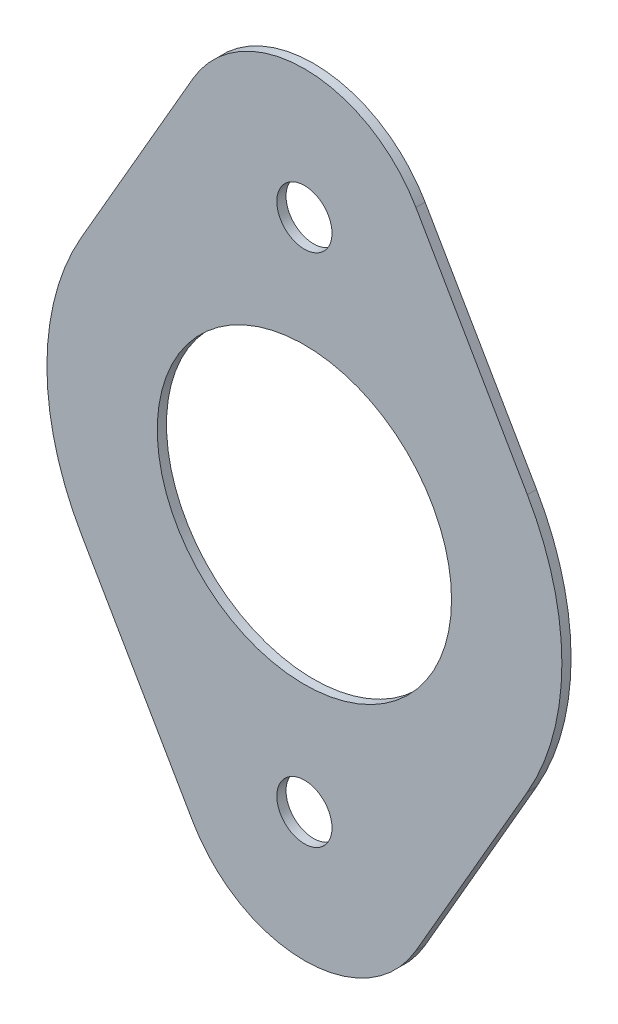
ISO-10303-21;
HEADER;
FILE_DESCRIPTION(('STEP AP214'),'2;1');
FILE_NAME('part.step','',(''),(''),'','','');
FILE_SCHEMA(('AUTOMOTIVE_DESIGN { 1 0 10303 214 1 1 1 1 }'));
ENDSEC;
DATA;
#1=APPLICATION_CONTEXT('core data for automotive mechanical design processes');
#2=APPLICATION_PROTOCOL_DEFINITION('international standard','automotive_design',2000,#1);
#3=PRODUCT_CONTEXT('',#1,'mechanical');
#4=PRODUCT('Part','Part','',(#3));
#5=PRODUCT_RELATED_PRODUCT_CATEGORY('part','',(#4));
#6=PRODUCT_DEFINITION_FORMATION('','',#4);
#7=PRODUCT_DEFINITION_CONTEXT('part definition',#1,'design');
#8=PRODUCT_DEFINITION('design','',#6,#7);
#9=PRODUCT_DEFINITION_SHAPE('','',#8);
#10=(LENGTH_UNIT() NAMED_UNIT(*) SI_UNIT(.MILLI.,.METRE.));
#11=(NAMED_UNIT(*) PLANE_ANGLE_UNIT() SI_UNIT($,.RADIAN.));
#12=(NAMED_UNIT(*) SI_UNIT($,.STERADIAN.) SOLID_ANGLE_UNIT());
#13=UNCERTAINTY_MEASURE_WITH_UNIT(LENGTH_MEASURE(1.E-05),#10,'distance_accuracy_value','');
#14=(GEOMETRIC_REPRESENTATION_CONTEXT(3) GLOBAL_UNCERTAINTY_ASSIGNED_CONTEXT((#13)) GLOBAL_UNIT_ASSIGNED_CONTEXT((#10,
#11,#12)) REPRESENTATION_CONTEXT('',''));
#15=CARTESIAN_POINT('',(0.,0.,0.));
#16=DIRECTION('',(0.,0.,1.));
#17=DIRECTION('',(1.,0.,0.));
#18=AXIS2_PLACEMENT_3D('',#15,#16,#17);
#19=CARTESIAN_POINT('',(0.,44.45,1.5875));
#20=DIRECTION('',(0.,0.,-1.));
#21=DIRECTION('',(-1.,0.,0.));
#22=AXIS2_PLACEMENT_3D('',#19,#20,#21);
#23=CYLINDRICAL_SURFACE('',#22,22.225);
#24=CARTESIAN_POINT('',(0.,44.45,0.));
#25=DIRECTION('',(0.,0.,-1.));
#26=DIRECTION('',(-1.,0.,0.));
#27=AXIS2_PLACEMENT_3D('',#24,#25,#26);
#28=CIRCLE('',#27,22.225);
#29=CARTESIAN_POINT('',(-19.2474145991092,55.5625,0.));
#30=VERTEX_POINT('',#29);
#31=CARTESIAN_POINT('',(19.2474145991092,55.5625,0.));
#32=VERTEX_POINT('',#31);
#33=EDGE_CURVE('E93',#30,#32,#28,.T.);
#34=ORIENTED_EDGE('',*,*,#33,.F.);
#35=DIRECTION('',(0.,0.,-1.));
#36=VECTOR('',#35,1.);
#37=CARTESIAN_POINT('',(-19.2474145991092,55.5625,1.5875));
#38=LINE('',#37,#36);
#39=CARTESIAN_POINT('',(-19.2474145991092,55.5625,1.5875));
#40=VERTEX_POINT('',#39);
#41=EDGE_CURVE('E11',#40,#30,#38,.T.);
#42=ORIENTED_EDGE('',*,*,#41,.F.);
#43=CARTESIAN_POINT('',(0.,44.45,1.5875));
#44=DIRECTION('',(0.,0.,-1.));
#45=DIRECTION('',(-1.,0.,0.));
#46=AXIS2_PLACEMENT_3D('',#43,#44,#45);
#47=CIRCLE('',#46,22.225);
#48=CARTESIAN_POINT('',(19.2474145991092,55.5625,1.5875));
#49=VERTEX_POINT('',#48);
#50=EDGE_CURVE('E94',#40,#49,#47,.T.);
#51=ORIENTED_EDGE('',*,*,#50,.T.);
#52=DIRECTION('',(0.,0.,-1.));
#53=VECTOR('',#52,1.);
#54=CARTESIAN_POINT('',(19.2474145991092,55.5625,1.5875));
#55=LINE('',#54,#53);
#56=EDGE_CURVE('E31',#49,#32,#55,.T.);
#57=ORIENTED_EDGE('',*,*,#56,.T.);
#58=EDGE_LOOP('',(#34,#42,#51,#57));
#59=FACE_BOUND('',#58,.T.);
#60=ADVANCED_FACE('F28',(#59),#23,.T.);
#61=CARTESIAN_POINT('',(-19.2474145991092,55.5625,1.5875));
#62=DIRECTION('',(0.866025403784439,-0.5,0.));
#63=DIRECTION('',(0.5,0.866025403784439,0.));
#64=AXIS2_PLACEMENT_3D('',#61,#62,#63);
#65=PLANE('',#64);
#66=DIRECTION('',(-0.5,-0.866025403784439,0.));
#67=VECTOR('',#66,1.);
#68=CARTESIAN_POINT('',(-19.2474145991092,55.5625,0.));
#69=LINE('',#68,#67);
#70=CARTESIAN_POINT('',(-38.4948291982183,22.225,0.));
#71=VERTEX_POINT('',#70);
#72=EDGE_CURVE('E111',#30,#71,#69,.T.);
#73=ORIENTED_EDGE('',*,*,#72,.T.);
#74=DIRECTION('',(0.,0.,-1.));
#75=VECTOR('',#74,1.);
#76=CARTESIAN_POINT('',(-38.4948291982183,22.225,1.5875));
#77=LINE('',#76,#75);
#78=CARTESIAN_POINT('',(-38.4948291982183,22.225,1.5875));
#79=VERTEX_POINT('',#78);
#80=EDGE_CURVE('E36',#79,#71,#77,.T.);
#81=ORIENTED_EDGE('',*,*,#80,.F.);
#82=DIRECTION('',(-0.5,-0.866025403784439,0.));
#83=VECTOR('',#82,1.);
#84=CARTESIAN_POINT('',(-19.2474145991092,55.5625,1.5875));
#85=LINE('',#84,#83);
#86=EDGE_CURVE('E49',#40,#79,#85,.T.);
#87=ORIENTED_EDGE('',*,*,#86,.F.);
#88=ORIENTED_EDGE('',*,*,#41,.T.);
#89=EDGE_LOOP('',(#73,#81,#87,#88));
#90=FACE_BOUND('',#89,.T.);
#91=ADVANCED_FACE('F177',(#90),#65,.F.);
#92=CARTESIAN_POINT('',(0.,0.,1.5875));
#93=DIRECTION('',(0.,0.,-1.));
#94=DIRECTION('',(-1.,0.,0.));
#95=AXIS2_PLACEMENT_3D('',#92,#93,#94);
#96=CYLINDRICAL_SURFACE('',#95,44.45);
#97=CARTESIAN_POINT('',(0.,0.,0.));
#98=DIRECTION('',(0.,0.,-1.));
#99=DIRECTION('',(-1.,0.,0.));
#100=AXIS2_PLACEMENT_3D('',#97,#98,#99);
#101=CIRCLE('',#100,44.45);
#102=CARTESIAN_POINT('',(-38.4948291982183,-22.225,0.));
#103=VERTEX_POINT('',#102);
#104=EDGE_CURVE('E128',#103,#71,#101,.T.);
#105=ORIENTED_EDGE('',*,*,#104,.F.);
#106=DIRECTION('',(0.,0.,-1.));
#107=VECTOR('',#106,1.);
#108=CARTESIAN_POINT('',(-38.4948291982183,-22.225,1.5875));
#109=LINE('',#108,#107);
#110=CARTESIAN_POINT('',(-38.4948291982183,-22.225,1.5875));
#111=VERTEX_POINT('',#110);
#112=EDGE_CURVE('E149',#111,#103,#109,.T.);
#113=ORIENTED_EDGE('',*,*,#112,.F.);
#114=CARTESIAN_POINT('',(0.,0.,1.5875));
#115=DIRECTION('',(0.,0.,-1.));
#116=DIRECTION('',(-1.,0.,0.));
#117=AXIS2_PLACEMENT_3D('',#114,#115,#116);
#118=CIRCLE('',#117,44.45);
#119=EDGE_CURVE('E144',#111,#79,#118,.T.);
#120=ORIENTED_EDGE('',*,*,#119,.T.);
#121=ORIENTED_EDGE('',*,*,#80,.T.);
#122=EDGE_LOOP('',(#105,#113,#120,#121));
#123=FACE_BOUND('',#122,.T.);
#124=ADVANCED_FACE('F175',(#123),#96,.T.);
#125=CARTESIAN_POINT('',(-19.2474145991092,-55.5625,1.5875));
#126=DIRECTION('',(-0.866025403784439,-0.5,0.));
#127=DIRECTION('',(0.5,-0.866025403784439,0.));
#128=AXIS2_PLACEMENT_3D('',#125,#126,#127);
#129=PLANE('',#128);
#130=DIRECTION('',(-0.5,0.866025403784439,0.));
#131=VECTOR('',#130,1.);
#132=CARTESIAN_POINT('',(-19.2474145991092,-55.5625,0.));
#133=LINE('',#132,#131);
#134=CARTESIAN_POINT('',(-19.2474145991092,-55.5625,0.));
#135=VERTEX_POINT('',#134);
#136=EDGE_CURVE('E125',#135,#103,#133,.T.);
#137=ORIENTED_EDGE('',*,*,#136,.F.);
#138=DIRECTION('',(0.,0.,-1.));
#139=VECTOR('',#138,1.);
#140=CARTESIAN_POINT('',(-19.2474145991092,-55.5625,1.5875));
#141=LINE('',#140,#139);
#142=CARTESIAN_POINT('',(-19.2474145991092,-55.5625,1.5875));
#143=VERTEX_POINT('',#142);
#144=EDGE_CURVE('E151',#143,#135,#141,.T.);
#145=ORIENTED_EDGE('',*,*,#144,.F.);
#146=DIRECTION('',(-0.5,0.866025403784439,0.));
#147=VECTOR('',#146,1.);
#148=CARTESIAN_POINT('',(-19.2474145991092,-55.5625,1.5875));
#149=LINE('',#148,#147);
#150=EDGE_CURVE('E141',#143,#111,#149,.T.);
#151=ORIENTED_EDGE('',*,*,#150,.T.);
#152=ORIENTED_EDGE('',*,*,#112,.T.);
#153=EDGE_LOOP('',(#137,#145,#151,#152));
#154=FACE_BOUND('',#153,.T.);
#155=ADVANCED_FACE('F170',(#154),#129,.T.);
#156=CARTESIAN_POINT('',(0.,-44.45,1.5875));
#157=DIRECTION('',(0.,0.,-1.));
#158=DIRECTION('',(-1.,0.,0.));
#159=AXIS2_PLACEMENT_3D('',#156,#157,#158);
#160=CYLINDRICAL_SURFACE('',#159,22.225);
#161=CARTESIAN_POINT('',(0.,-44.45,0.));
#162=DIRECTION('',(0.,0.,1.));
#163=DIRECTION('',(1.,0.,0.));
#164=AXIS2_PLACEMENT_3D('',#161,#162,#163);
#165=CIRCLE('',#164,22.225);
#166=CARTESIAN_POINT('',(19.2474145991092,-55.5625,0.));
#167=VERTEX_POINT('',#166);
#168=EDGE_CURVE('E123',#135,#167,#165,.T.);
#169=ORIENTED_EDGE('',*,*,#168,.T.);
#170=DIRECTION('',(0.,0.,-1.));
#171=VECTOR('',#170,1.);
#172=CARTESIAN_POINT('',(19.2474145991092,-55.5625,1.5875));
#173=LINE('',#172,#171);
#174=CARTESIAN_POINT('',(19.2474145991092,-55.5625,1.5875));
#175=VERTEX_POINT('',#174);
#176=EDGE_CURVE('E153',#175,#167,#173,.T.);
#177=ORIENTED_EDGE('',*,*,#176,.F.);
#178=CARTESIAN_POINT('',(0.,-44.45,1.5875));
#179=DIRECTION('',(0.,0.,1.));
#180=DIRECTION('',(1.,0.,0.));
#181=AXIS2_PLACEMENT_3D('',#178,#179,#180);
#182=CIRCLE('',#181,22.225);
#183=EDGE_CURVE('E139',#143,#175,#182,.T.);
#184=ORIENTED_EDGE('',*,*,#183,.F.);
#185=ORIENTED_EDGE('',*,*,#144,.T.);
#186=EDGE_LOOP('',(#169,#177,#184,#185));
#187=FACE_BOUND('',#186,.T.);
#188=ADVANCED_FACE('F179',(#187),#160,.T.);
#189=CARTESIAN_POINT('',(19.2474145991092,-55.5625,1.5875));
#190=DIRECTION('',(-0.866025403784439,0.5,0.));
#191=DIRECTION('',(-0.5,-0.866025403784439,0.));
#192=AXIS2_PLACEMENT_3D('',#189,#190,#191);
#193=PLANE('',#192);
#194=DIRECTION('',(0.5,0.866025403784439,0.));
#195=VECTOR('',#194,1.);
#196=CARTESIAN_POINT('',(19.2474145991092,-55.5625,0.));
#197=LINE('',#196,#195);
#198=CARTESIAN_POINT('',(38.4948291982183,-22.225,0.));
#199=VERTEX_POINT('',#198);
#200=EDGE_CURVE('E120',#167,#199,#197,.T.);
#201=ORIENTED_EDGE('',*,*,#200,.T.);
#202=DIRECTION('',(0.,0.,-1.));
#203=VECTOR('',#202,1.);
#204=CARTESIAN_POINT('',(38.4948291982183,-22.225,1.5875));
#205=LINE('',#204,#203);
#206=CARTESIAN_POINT('',(38.4948291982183,-22.225,1.5875));
#207=VERTEX_POINT('',#206);
#208=EDGE_CURVE('E156',#207,#199,#205,.T.);
#209=ORIENTED_EDGE('',*,*,#208,.F.);
#210=DIRECTION('',(0.5,0.866025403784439,0.));
#211=VECTOR('',#210,1.);
#212=CARTESIAN_POINT('',(19.2474145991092,-55.5625,1.5875));
#213=LINE('',#212,#211);
#214=EDGE_CURVE('E137',#175,#207,#213,.T.);
#215=ORIENTED_EDGE('',*,*,#214,.F.);
#216=ORIENTED_EDGE('',*,*,#176,.T.);
#217=EDGE_LOOP('',(#201,#209,#215,#216));
#218=FACE_BOUND('',#217,.T.);
#219=ADVANCED_FACE('F164',(#218),#193,.F.);
#220=CARTESIAN_POINT('',(0.,0.,1.5875));
#221=DIRECTION('',(0.,0.,-1.));
#222=DIRECTION('',(-1.,0.,0.));
#223=AXIS2_PLACEMENT_3D('',#220,#221,#222);
#224=CYLINDRICAL_SURFACE('',#223,44.45);
#225=CARTESIAN_POINT('',(0.,0.,0.));
#226=DIRECTION('',(0.,0.,-1.));
#227=DIRECTION('',(-1.,0.,0.));
#228=AXIS2_PLACEMENT_3D('',#225,#226,#227);
#229=CIRCLE('',#228,44.45);
#230=CARTESIAN_POINT('',(38.4948291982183,22.225,0.));
#231=VERTEX_POINT('',#230);
#232=EDGE_CURVE('E105',#231,#199,#229,.T.);
#233=ORIENTED_EDGE('',*,*,#232,.F.);
#234=DIRECTION('',(0.,0.,-1.));
#235=VECTOR('',#234,1.);
#236=CARTESIAN_POINT('',(38.4948291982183,22.225,1.5875));
#237=LINE('',#236,#235);
#238=CARTESIAN_POINT('',(38.4948291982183,22.225,1.5875));
#239=VERTEX_POINT('',#238);
#240=EDGE_CURVE('E98',#239,#231,#237,.T.);
#241=ORIENTED_EDGE('',*,*,#240,.F.);
#242=CARTESIAN_POINT('',(0.,0.,1.5875));
#243=DIRECTION('',(0.,0.,-1.));
#244=DIRECTION('',(-1.,0.,0.));
#245=AXIS2_PLACEMENT_3D('',#242,#243,#244);
#246=CIRCLE('',#245,44.45);
#247=EDGE_CURVE('E134',#239,#207,#246,.T.);
#248=ORIENTED_EDGE('',*,*,#247,.T.);
#249=ORIENTED_EDGE('',*,*,#208,.T.);
#250=EDGE_LOOP('',(#233,#241,#248,#249));
#251=FACE_BOUND('',#250,.T.);
#252=ADVANCED_FACE('F159',(#251),#224,.T.);
#253=CARTESIAN_POINT('',(19.2474145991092,55.5625,1.5875));
#254=DIRECTION('',(0.866025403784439,0.5,0.));
#255=DIRECTION('',(-0.5,0.866025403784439,0.));
#256=AXIS2_PLACEMENT_3D('',#253,#254,#255);
#257=PLANE('',#256);
#258=DIRECTION('',(0.5,-0.866025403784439,0.));
#259=VECTOR('',#258,1.);
#260=CARTESIAN_POINT('',(19.2474145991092,55.5625,0.));
#261=LINE('',#260,#259);
#262=EDGE_CURVE('E100',#32,#231,#261,.T.);
#263=ORIENTED_EDGE('',*,*,#262,.F.);
#264=ORIENTED_EDGE('',*,*,#56,.F.);
#265=DIRECTION('',(0.5,-0.866025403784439,0.));
#266=VECTOR('',#265,1.);
#267=CARTESIAN_POINT('',(19.2474145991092,55.5625,1.5875));
#268=LINE('',#267,#266);
#269=EDGE_CURVE('E132',#49,#239,#268,.T.);
#270=ORIENTED_EDGE('',*,*,#269,.T.);
#271=ORIENTED_EDGE('',*,*,#240,.T.);
#272=EDGE_LOOP('',(#263,#264,#270,#271));
#273=FACE_BOUND('',#272,.T.);
#274=ADVANCED_FACE('F101',(#273),#257,.T.);
#275=CARTESIAN_POINT('',(0.,44.45,1.5875));
#276=DIRECTION('',(0.,0.,-1.));
#277=DIRECTION('',(-1.,0.,0.));
#278=AXIS2_PLACEMENT_3D('',#275,#276,#277);
#279=PLANE('',#278);
#280=CARTESIAN_POINT('',(0.,0.,1.5875));
#281=DIRECTION('',(0.,0.,1.));
#282=DIRECTION('',(1.,0.,0.));
#283=AXIS2_PLACEMENT_3D('',#280,#281,#282);
#284=CIRCLE('',#283,25.4);
#285=CARTESIAN_POINT('',(25.4,0.,1.5875));
#286=VERTEX_POINT('',#285);
#287=EDGE_CURVE('E223',#286,#286,#284,.T.);
#288=ORIENTED_EDGE('',*,*,#287,.F.);
#289=EDGE_LOOP('',(#288));
#290=FACE_BOUND('',#289,.T.);
#291=CARTESIAN_POINT('',(0.,-44.45,1.5875));
#292=DIRECTION('',(0.,0.,1.));
#293=DIRECTION('',(1.,0.,0.));
#294=AXIS2_PLACEMENT_3D('',#291,#292,#293);
#295=CIRCLE('',#294,4.7625);
#296=CARTESIAN_POINT('',(4.7625,-44.45,1.5875));
#297=VERTEX_POINT('',#296);
#298=EDGE_CURVE('E225',#297,#297,#295,.T.);
#299=ORIENTED_EDGE('',*,*,#298,.F.);
#300=EDGE_LOOP('',(#299));
#301=FACE_BOUND('',#300,.T.);
#302=CARTESIAN_POINT('',(0.,44.45,1.5875));
#303=DIRECTION('',(0.,0.,1.));
#304=DIRECTION('',(1.,0.,0.));
#305=AXIS2_PLACEMENT_3D('',#302,#303,#304);
#306=CIRCLE('',#305,4.7625);
#307=CARTESIAN_POINT('',(4.7625,44.45,1.5875));
#308=VERTEX_POINT('',#307);
#309=EDGE_CURVE('E115',#308,#308,#306,.T.);
#310=ORIENTED_EDGE('',*,*,#309,.F.);
#311=EDGE_LOOP('',(#310));
#312=FACE_BOUND('',#311,.T.);
#313=ORIENTED_EDGE('',*,*,#50,.F.);
#314=ORIENTED_EDGE('',*,*,#86,.T.);
#315=ORIENTED_EDGE('',*,*,#119,.F.);
#316=ORIENTED_EDGE('',*,*,#150,.F.);
#317=ORIENTED_EDGE('',*,*,#183,.T.);
#318=ORIENTED_EDGE('',*,*,#214,.T.);
#319=ORIENTED_EDGE('',*,*,#247,.F.);
#320=ORIENTED_EDGE('',*,*,#269,.F.);
#321=EDGE_LOOP('',(#313,#314,#315,#316,#317,#318,#319,#320));
#322=FACE_BOUND('',#321,.T.);
#323=ADVANCED_FACE('F178',(#290,#301,#312,#322),#279,.F.);
#324=CARTESIAN_POINT('',(0.,44.45,0.));
#325=DIRECTION('',(0.,0.,-1.));
#326=DIRECTION('',(-1.,0.,0.));
#327=AXIS2_PLACEMENT_3D('',#324,#325,#326);
#328=PLANE('',#327);
#329=CARTESIAN_POINT('',(0.,0.,0.));
#330=DIRECTION('',(0.,0.,1.));
#331=DIRECTION('',(1.,0.,0.));
#332=AXIS2_PLACEMENT_3D('',#329,#330,#331);
#333=CIRCLE('',#332,25.4);
#334=CARTESIAN_POINT('',(25.4,0.,0.));
#335=VERTEX_POINT('',#334);
#336=EDGE_CURVE('E220',#335,#335,#333,.T.);
#337=ORIENTED_EDGE('',*,*,#336,.T.);
#338=EDGE_LOOP('',(#337));
#339=FACE_BOUND('',#338,.T.);
#340=CARTESIAN_POINT('',(0.,-44.45,0.));
#341=DIRECTION('',(0.,0.,1.));
#342=DIRECTION('',(1.,0.,0.));
#343=AXIS2_PLACEMENT_3D('',#340,#341,#342);
#344=CIRCLE('',#343,4.7625);
#345=CARTESIAN_POINT('',(4.7625,-44.45,0.));
#346=VERTEX_POINT('',#345);
#347=EDGE_CURVE('E230',#346,#346,#344,.T.);
#348=ORIENTED_EDGE('',*,*,#347,.T.);
#349=EDGE_LOOP('',(#348));
#350=FACE_BOUND('',#349,.T.);
#351=CARTESIAN_POINT('',(0.,44.45,0.));
#352=DIRECTION('',(0.,0.,1.));
#353=DIRECTION('',(1.,0.,0.));
#354=AXIS2_PLACEMENT_3D('',#351,#352,#353);
#355=CIRCLE('',#354,4.7625);
#356=CARTESIAN_POINT('',(4.7625,44.45,0.));
#357=VERTEX_POINT('',#356);
#358=EDGE_CURVE('E112',#357,#357,#355,.T.);
#359=ORIENTED_EDGE('',*,*,#358,.T.);
#360=EDGE_LOOP('',(#359));
#361=FACE_BOUND('',#360,.T.);
#362=ORIENTED_EDGE('',*,*,#33,.T.);
#363=ORIENTED_EDGE('',*,*,#262,.T.);
#364=ORIENTED_EDGE('',*,*,#232,.T.);
#365=ORIENTED_EDGE('',*,*,#200,.F.);
#366=ORIENTED_EDGE('',*,*,#168,.F.);
#367=ORIENTED_EDGE('',*,*,#136,.T.);
#368=ORIENTED_EDGE('',*,*,#104,.T.);
#369=ORIENTED_EDGE('',*,*,#72,.F.);
#370=EDGE_LOOP('',(#362,#363,#364,#365,#366,#367,#368,#369));
#371=FACE_BOUND('',#370,.T.);
#372=ADVANCED_FACE('F108',(#339,#350,#361,#371),#328,.T.);
#373=CARTESIAN_POINT('',(0.,44.45,0.));
#374=DIRECTION('',(0.,0.,1.));
#375=DIRECTION('',(1.,0.,0.));
#376=AXIS2_PLACEMENT_3D('',#373,#374,#375);
#377=CYLINDRICAL_SURFACE('',#376,4.7625);
#378=ORIENTED_EDGE('',*,*,#358,.F.);
#379=EDGE_LOOP('',(#378));
#380=FACE_BOUND('',#379,.T.);
#381=ORIENTED_EDGE('',*,*,#309,.T.);
#382=EDGE_LOOP('',(#381));
#383=FACE_BOUND('',#382,.T.);
#384=ADVANCED_FACE('F203',(#380,#383),#377,.F.);
#385=CARTESIAN_POINT('',(0.,-44.45,0.));
#386=DIRECTION('',(0.,0.,1.));
#387=DIRECTION('',(1.,0.,0.));
#388=AXIS2_PLACEMENT_3D('',#385,#386,#387);
#389=CYLINDRICAL_SURFACE('',#388,4.7625);
#390=ORIENTED_EDGE('',*,*,#347,.F.);
#391=EDGE_LOOP('',(#390));
#392=FACE_BOUND('',#391,.T.);
#393=ORIENTED_EDGE('',*,*,#298,.T.);
#394=EDGE_LOOP('',(#393));
#395=FACE_BOUND('',#394,.T.);
#396=ADVANCED_FACE('F207',(#392,#395),#389,.F.);
#397=CARTESIAN_POINT('',(0.,0.,0.));
#398=DIRECTION('',(0.,0.,1.));
#399=DIRECTION('',(1.,0.,0.));
#400=AXIS2_PLACEMENT_3D('',#397,#398,#399);
#401=CYLINDRICAL_SURFACE('',#400,25.4);
#402=ORIENTED_EDGE('',*,*,#336,.F.);
#403=EDGE_LOOP('',(#402));
#404=FACE_BOUND('',#403,.T.);
#405=ORIENTED_EDGE('',*,*,#287,.T.);
#406=EDGE_LOOP('',(#405));
#407=FACE_BOUND('',#406,.T.);
#408=ADVANCED_FACE('F211',(#404,#407),#401,.F.);
#409=CLOSED_SHELL('',(#60,#91,#124,#155,#188,#219,#252,#274,#323,#372,#384,#396,#408));
#410=MANIFOLD_SOLID_BREP('B2',#409);
#411=ADVANCED_BREP_SHAPE_REPRESENTATION('',(#18,#410),#14);
#412=SHAPE_DEFINITION_REPRESENTATION(#9,#411);
ENDSEC;
END-ISO-10303-21;
